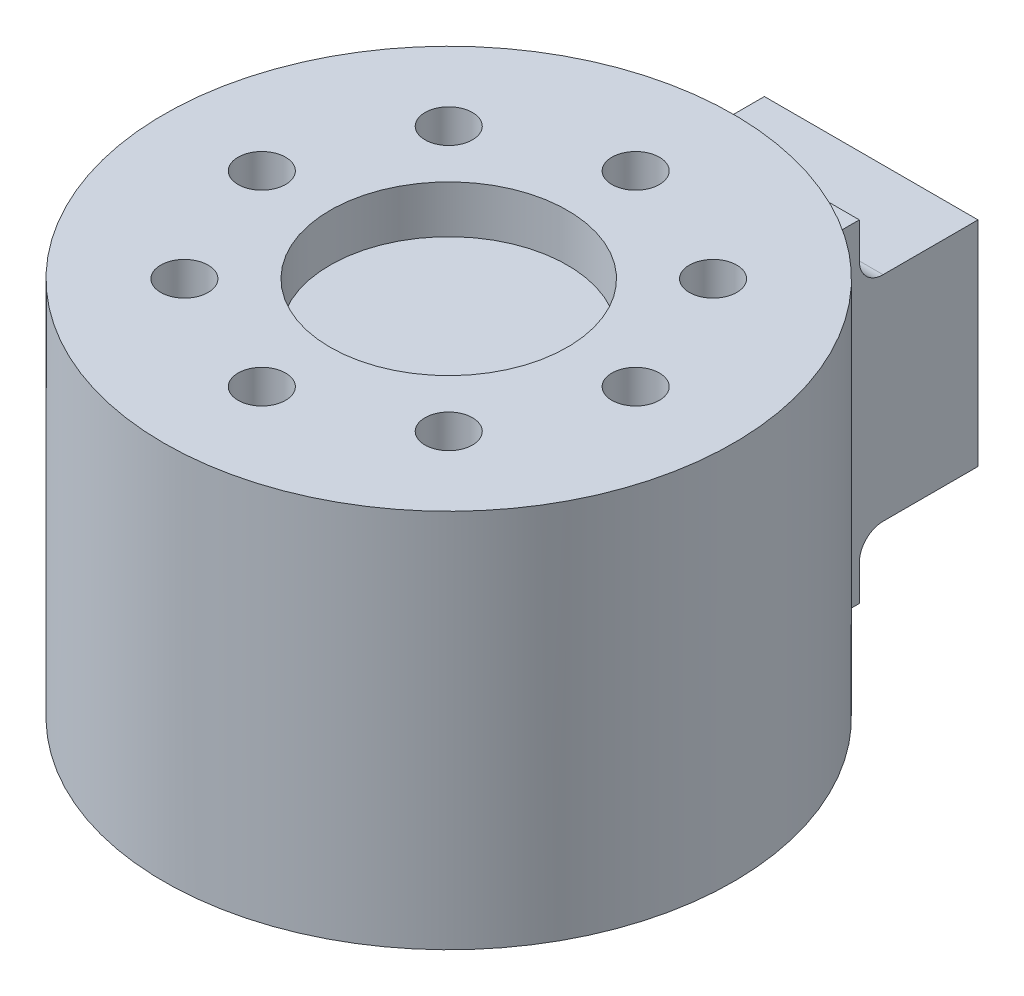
ISO-10303-21;
HEADER;
FILE_DESCRIPTION(('STEP AP214'),'2;1');
FILE_NAME('part.step','',(''),(''),'','','');
FILE_SCHEMA(('AUTOMOTIVE_DESIGN { 1 0 10303 214 1 1 1 1 }'));
ENDSEC;
DATA;
#1=APPLICATION_CONTEXT('core data for automotive mechanical design processes');
#2=APPLICATION_PROTOCOL_DEFINITION('international standard','automotive_design',2000,#1);
#3=PRODUCT_CONTEXT('',#1,'mechanical');
#4=PRODUCT('Part','Part','',(#3));
#5=PRODUCT_RELATED_PRODUCT_CATEGORY('part','',(#4));
#6=PRODUCT_DEFINITION_FORMATION('','',#4);
#7=PRODUCT_DEFINITION_CONTEXT('part definition',#1,'design');
#8=PRODUCT_DEFINITION('design','',#6,#7);
#9=PRODUCT_DEFINITION_SHAPE('','',#8);
#10=(LENGTH_UNIT() NAMED_UNIT(*) SI_UNIT(.MILLI.,.METRE.));
#11=(NAMED_UNIT(*) PLANE_ANGLE_UNIT() SI_UNIT($,.RADIAN.));
#12=(NAMED_UNIT(*) SI_UNIT($,.STERADIAN.) SOLID_ANGLE_UNIT());
#13=UNCERTAINTY_MEASURE_WITH_UNIT(LENGTH_MEASURE(1.E-05),#10,'distance_accuracy_value','');
#14=(GEOMETRIC_REPRESENTATION_CONTEXT(3) GLOBAL_UNCERTAINTY_ASSIGNED_CONTEXT((#13)) GLOBAL_UNIT_ASSIGNED_CONTEXT((#10,
#11,#12)) REPRESENTATION_CONTEXT('',''));
#15=CARTESIAN_POINT('',(0.,0.,0.));
#16=DIRECTION('',(0.,0.,1.));
#17=DIRECTION('',(1.,0.,0.));
#18=AXIS2_PLACEMENT_3D('',#15,#16,#17);
#19=CARTESIAN_POINT('',(0.,32.,0.));
#20=DIRECTION('',(0.,-1.,0.));
#21=DIRECTION('',(0.,0.,-1.));
#22=AXIS2_PLACEMENT_3D('',#19,#20,#21);
#23=CYLINDRICAL_SURFACE('',#22,24.);
#24=CARTESIAN_POINT('',(0.,0.,0.));
#25=DIRECTION('',(0.,1.,0.));
#26=DIRECTION('',(0.,0.,1.));
#27=AXIS2_PLACEMENT_3D('',#24,#25,#26);
#28=CIRCLE('',#27,24.);
#29=CARTESIAN_POINT('',(-9.,0.,-22.248595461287));
#30=VERTEX_POINT('',#29);
#31=CARTESIAN_POINT('',(9.,0.,-22.248595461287));
#32=VERTEX_POINT('',#31);
#33=EDGE_CURVE('E152',#30,#32,#28,.T.);
#34=ORIENTED_EDGE('',*,*,#33,.T.);
#35=DIRECTION('',(0.,-1.,0.));
#36=VECTOR('',#35,1.);
#37=CARTESIAN_POINT('',(9.,32.,-22.248595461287));
#38=LINE('',#37,#36);
#39=CARTESIAN_POINT('',(9.,28.,-22.248595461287));
#40=VERTEX_POINT('',#39);
#41=EDGE_CURVE('E145',#32,#40,#38,.F.);
#42=ORIENTED_EDGE('',*,*,#41,.T.);
#43=CARTESIAN_POINT('',(0.,28.,0.));
#44=DIRECTION('',(0.,1.,0.));
#45=DIRECTION('',(0.,0.,1.));
#46=AXIS2_PLACEMENT_3D('',#43,#44,#45);
#47=CIRCLE('',#46,24.);
#48=CARTESIAN_POINT('',(-9.,28.,-22.248595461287));
#49=VERTEX_POINT('',#48);
#50=EDGE_CURVE('E130',#40,#49,#47,.T.);
#51=ORIENTED_EDGE('',*,*,#50,.T.);
#52=DIRECTION('',(0.,-1.,0.));
#53=VECTOR('',#52,1.);
#54=CARTESIAN_POINT('',(-9.,32.,-22.248595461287));
#55=LINE('',#54,#53);
#56=EDGE_CURVE('E142',#49,#30,#55,.T.);
#57=ORIENTED_EDGE('',*,*,#56,.T.);
#58=EDGE_LOOP('',(#34,#42,#51,#57));
#59=FACE_BOUND('',#58,.T.);
#60=CARTESIAN_POINT('',(0.,32.,0.));
#61=DIRECTION('',(0.,1.,0.));
#62=DIRECTION('',(0.,0.,1.));
#63=AXIS2_PLACEMENT_3D('',#60,#61,#62);
#64=CIRCLE('',#63,24.);
#65=CARTESIAN_POINT('',(0.,32.,24.));
#66=VERTEX_POINT('',#65);
#67=EDGE_CURVE('E155',#66,#66,#64,.T.);
#68=ORIENTED_EDGE('',*,*,#67,.F.);
#69=EDGE_LOOP('',(#68));
#70=FACE_BOUND('',#69,.T.);
#71=ADVANCED_FACE('F38',(#59,#70),#23,.T.);
#72=CARTESIAN_POINT('',(0.,32.,0.));
#73=DIRECTION('',(0.,1.,0.));
#74=DIRECTION('',(0.,0.,1.));
#75=AXIS2_PLACEMENT_3D('',#72,#73,#74);
#76=PLANE('',#75);
#77=CARTESIAN_POINT('',(-15.75,32.,0.));
#78=DIRECTION('',(0.,1.,0.));
#79=DIRECTION('',(-1.,0.,0.));
#80=AXIS2_PLACEMENT_3D('',#77,#78,#79);
#81=CIRCLE('',#80,2.);
#82=CARTESIAN_POINT('',(-17.75,32.,0.));
#83=VERTEX_POINT('',#82);
#84=EDGE_CURVE('E233',#83,#83,#81,.T.);
#85=ORIENTED_EDGE('',*,*,#84,.F.);
#86=EDGE_LOOP('',(#85));
#87=FACE_BOUND('',#86,.T.);
#88=CARTESIAN_POINT('',(-11.1369318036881,32.,-11.1369318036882));
#89=DIRECTION('',(0.,1.,0.));
#90=DIRECTION('',(-0.707106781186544,0.,-0.707106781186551));
#91=AXIS2_PLACEMENT_3D('',#88,#89,#90);
#92=CIRCLE('',#91,2.);
#93=CARTESIAN_POINT('',(-12.5511453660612,32.,-12.5511453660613));
#94=VERTEX_POINT('',#93);
#95=EDGE_CURVE('E239',#94,#94,#92,.T.);
#96=ORIENTED_EDGE('',*,*,#95,.F.);
#97=EDGE_LOOP('',(#96));
#98=FACE_BOUND('',#97,.T.);
#99=CARTESIAN_POINT('',(0.,32.,-15.75));
#100=DIRECTION('',(0.,1.,0.));
#101=DIRECTION('',(0.,0.,-1.));
#102=AXIS2_PLACEMENT_3D('',#99,#100,#101);
#103=CIRCLE('',#102,2.);
#104=CARTESIAN_POINT('',(0.,32.,-17.75));
#105=VERTEX_POINT('',#104);
#106=EDGE_CURVE('E245',#105,#105,#103,.T.);
#107=ORIENTED_EDGE('',*,*,#106,.F.);
#108=EDGE_LOOP('',(#107));
#109=FACE_BOUND('',#108,.T.);
#110=CARTESIAN_POINT('',(11.1369318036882,32.,-11.136931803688));
#111=DIRECTION('',(0.,1.,0.));
#112=DIRECTION('',(0.707106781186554,0.,-0.707106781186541));
#113=AXIS2_PLACEMENT_3D('',#110,#111,#112);
#114=CIRCLE('',#113,2.);
#115=CARTESIAN_POINT('',(12.5511453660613,32.,-12.5511453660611));
#116=VERTEX_POINT('',#115);
#117=EDGE_CURVE('E220',#116,#116,#114,.T.);
#118=ORIENTED_EDGE('',*,*,#117,.F.);
#119=EDGE_LOOP('',(#118));
#120=FACE_BOUND('',#119,.T.);
#121=CARTESIAN_POINT('',(15.75,32.,1.64972493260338E-13));
#122=DIRECTION('',(0.,1.,0.));
#123=DIRECTION('',(1.,0.,0.));
#124=AXIS2_PLACEMENT_3D('',#121,#122,#123);
#125=CIRCLE('',#124,2.);
#126=CARTESIAN_POINT('',(17.75,32.,1.85921381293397E-13));
#127=VERTEX_POINT('',#126);
#128=EDGE_CURVE('E221',#127,#127,#125,.T.);
#129=ORIENTED_EDGE('',*,*,#128,.F.);
#130=EDGE_LOOP('',(#129));
#131=FACE_BOUND('',#130,.T.);
#132=CARTESIAN_POINT('',(11.136931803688,32.,11.1369318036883));
#133=DIRECTION('',(0.,1.,0.));
#134=DIRECTION('',(0.707106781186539,0.,0.707106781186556));
#135=AXIS2_PLACEMENT_3D('',#132,#133,#134);
#136=CIRCLE('',#135,2.);
#137=CARTESIAN_POINT('',(12.5511453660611,32.,12.5511453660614));
#138=VERTEX_POINT('',#137);
#139=EDGE_CURVE('E216',#138,#138,#136,.T.);
#140=ORIENTED_EDGE('',*,*,#139,.F.);
#141=EDGE_LOOP('',(#140));
#142=FACE_BOUND('',#141,.T.);
#143=CARTESIAN_POINT('',(-11.1369318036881,32.,11.1369318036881));
#144=DIRECTION('',(0.,1.,0.));
#145=DIRECTION('',(-0.707106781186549,0.,0.707106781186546));
#146=AXIS2_PLACEMENT_3D('',#143,#144,#145);
#147=CIRCLE('',#146,2.);
#148=CARTESIAN_POINT('',(-12.5511453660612,32.,12.5511453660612));
#149=VERTEX_POINT('',#148);
#150=EDGE_CURVE('E232',#149,#149,#147,.T.);
#151=ORIENTED_EDGE('',*,*,#150,.F.);
#152=EDGE_LOOP('',(#151));
#153=FACE_BOUND('',#152,.T.);
#154=CARTESIAN_POINT('',(0.,32.,15.75));
#155=DIRECTION('',(0.,1.,0.));
#156=DIRECTION('',(0.,0.,1.));
#157=AXIS2_PLACEMENT_3D('',#154,#155,#156);
#158=CIRCLE('',#157,2.);
#159=CARTESIAN_POINT('',(0.,32.,17.75));
#160=VERTEX_POINT('',#159);
#161=EDGE_CURVE('E298',#160,#160,#158,.T.);
#162=ORIENTED_EDGE('',*,*,#161,.F.);
#163=EDGE_LOOP('',(#162));
#164=FACE_BOUND('',#163,.T.);
#165=CARTESIAN_POINT('',(0.,32.,0.));
#166=DIRECTION('',(0.,1.,0.));
#167=DIRECTION('',(0.,0.,1.));
#168=AXIS2_PLACEMENT_3D('',#165,#166,#167);
#169=CIRCLE('',#168,10.);
#170=CARTESIAN_POINT('',(0.,32.,10.));
#171=VERTEX_POINT('',#170);
#172=EDGE_CURVE('E148',#171,#171,#169,.T.);
#173=ORIENTED_EDGE('',*,*,#172,.F.);
#174=EDGE_LOOP('',(#173));
#175=FACE_BOUND('',#174,.T.);
#176=ORIENTED_EDGE('',*,*,#67,.T.);
#177=EDGE_LOOP('',(#176));
#178=FACE_BOUND('',#177,.T.);
#179=ADVANCED_FACE('F321',(#87,#98,#109,#120,#131,#142,#153,#164,#175,#178),#76,.T.);
#180=CARTESIAN_POINT('',(0.,0.,0.));
#181=DIRECTION('',(0.,1.,0.));
#182=DIRECTION('',(0.,0.,1.));
#183=AXIS2_PLACEMENT_3D('',#180,#181,#182);
#184=PLANE('',#183);
#185=CARTESIAN_POINT('',(0.,0.,22.));
#186=DIRECTION('',(0.,-1.,0.));
#187=DIRECTION('',(1.,0.,0.));
#188=AXIS2_PLACEMENT_3D('',#185,#186,#187);
#189=CIRCLE('',#188,1.5);
#190=CARTESIAN_POINT('',(1.49999999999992,0.,22.));
#191=VERTEX_POINT('',#190);
#192=EDGE_CURVE('E275',#191,#191,#189,.T.);
#193=ORIENTED_EDGE('',*,*,#192,.F.);
#194=EDGE_LOOP('',(#193));
#195=FACE_BOUND('',#194,.T.);
#196=CARTESIAN_POINT('',(-15.5563491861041,0.,15.556349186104));
#197=DIRECTION('',(0.,-1.,0.));
#198=DIRECTION('',(0.707106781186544,0.,0.707106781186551));
#199=AXIS2_PLACEMENT_3D('',#196,#197,#198);
#200=CIRCLE('',#199,1.5);
#201=CARTESIAN_POINT('',(-14.4956890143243,0.,16.6170093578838));
#202=VERTEX_POINT('',#201);
#203=EDGE_CURVE('E281',#202,#202,#200,.T.);
#204=ORIENTED_EDGE('',*,*,#203,.F.);
#205=EDGE_LOOP('',(#204));
#206=FACE_BOUND('',#205,.T.);
#207=CARTESIAN_POINT('',(-22.,0.,0.));
#208=DIRECTION('',(0.,-1.,0.));
#209=DIRECTION('',(0.,0.,1.));
#210=AXIS2_PLACEMENT_3D('',#207,#208,#209);
#211=CIRCLE('',#210,1.5);
#212=CARTESIAN_POINT('',(-22.,0.,1.5));
#213=VERTEX_POINT('',#212);
#214=EDGE_CURVE('E287',#213,#213,#211,.T.);
#215=ORIENTED_EDGE('',*,*,#214,.F.);
#216=EDGE_LOOP('',(#215));
#217=FACE_BOUND('',#216,.T.);
#218=CARTESIAN_POINT('',(-15.5563491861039,0.,-15.5563491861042));
#219=DIRECTION('',(0.,-1.,0.));
#220=DIRECTION('',(-0.707106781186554,0.,0.707106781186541));
#221=AXIS2_PLACEMENT_3D('',#218,#219,#220);
#222=CIRCLE('',#221,1.5);
#223=CARTESIAN_POINT('',(-16.6170093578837,0.,-14.4956890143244));
#224=VERTEX_POINT('',#223);
#225=EDGE_CURVE('E262',#224,#224,#222,.T.);
#226=ORIENTED_EDGE('',*,*,#225,.F.);
#227=EDGE_LOOP('',(#226));
#228=FACE_BOUND('',#227,.T.);
#229=CARTESIAN_POINT('',(2.30437768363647E-13,0.,-22.));
#230=DIRECTION('',(0.,-1.,0.));
#231=DIRECTION('',(-1.,0.,0.));
#232=AXIS2_PLACEMENT_3D('',#229,#230,#231);
#233=CIRCLE('',#232,1.5);
#234=CARTESIAN_POINT('',(-1.49999999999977,0.,-22.));
#235=VERTEX_POINT('',#234);
#236=EDGE_CURVE('E263',#235,#235,#233,.T.);
#237=ORIENTED_EDGE('',*,*,#236,.F.);
#238=EDGE_LOOP('',(#237));
#239=FACE_BOUND('',#238,.T.);
#240=CARTESIAN_POINT('',(15.5563491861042,0.,-15.5563491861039));
#241=DIRECTION('',(0.,-1.,0.));
#242=DIRECTION('',(-0.707106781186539,0.,-0.707106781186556));
#243=AXIS2_PLACEMENT_3D('',#240,#241,#242);
#244=CIRCLE('',#243,1.5);
#245=CARTESIAN_POINT('',(14.4956890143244,0.,-16.6170093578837));
#246=VERTEX_POINT('',#245);
#247=EDGE_CURVE('E256',#246,#246,#244,.T.);
#248=ORIENTED_EDGE('',*,*,#247,.F.);
#249=EDGE_LOOP('',(#248));
#250=FACE_BOUND('',#249,.T.);
#251=CARTESIAN_POINT('',(15.556349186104,0.,15.5563491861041));
#252=DIRECTION('',(0.,-1.,0.));
#253=DIRECTION('',(0.707106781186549,0.,-0.707106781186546));
#254=AXIS2_PLACEMENT_3D('',#251,#252,#253);
#255=CIRCLE('',#254,1.5);
#256=CARTESIAN_POINT('',(16.6170093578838,0.,14.4956890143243));
#257=VERTEX_POINT('',#256);
#258=EDGE_CURVE('E274',#257,#257,#255,.T.);
#259=ORIENTED_EDGE('',*,*,#258,.F.);
#260=EDGE_LOOP('',(#259));
#261=FACE_BOUND('',#260,.T.);
#262=CARTESIAN_POINT('',(22.,0.,0.));
#263=DIRECTION('',(0.,-1.,0.));
#264=DIRECTION('',(0.,0.,-1.));
#265=AXIS2_PLACEMENT_3D('',#262,#263,#264);
#266=CIRCLE('',#265,1.5);
#267=CARTESIAN_POINT('',(22.,0.,-1.5));
#268=VERTEX_POINT('',#267);
#269=EDGE_CURVE('E304',#268,#268,#266,.T.);
#270=ORIENTED_EDGE('',*,*,#269,.F.);
#271=EDGE_LOOP('',(#270));
#272=FACE_BOUND('',#271,.T.);
#273=DIRECTION('',(0.,0.,1.));
#274=VECTOR('',#273,1.);
#275=CARTESIAN_POINT('',(-9.,0.,-35.6));
#276=LINE('',#275,#274);
#277=CARTESIAN_POINT('',(-9.,0.,-25.6));
#278=VERTEX_POINT('',#277);
#279=EDGE_CURVE('E135',#278,#30,#276,.T.);
#280=ORIENTED_EDGE('',*,*,#279,.F.);
#281=DIRECTION('',(1.,0.,0.));
#282=VECTOR('',#281,1.);
#283=CARTESIAN_POINT('',(-24.,0.,-25.6));
#284=LINE('',#283,#282);
#285=CARTESIAN_POINT('',(9.,0.,-25.6));
#286=VERTEX_POINT('',#285);
#287=EDGE_CURVE('E126',#278,#286,#284,.T.);
#288=ORIENTED_EDGE('',*,*,#287,.T.);
#289=DIRECTION('',(0.,0.,1.));
#290=VECTOR('',#289,1.);
#291=CARTESIAN_POINT('',(9.,0.,-35.6));
#292=LINE('',#291,#290);
#293=EDGE_CURVE('E146',#286,#32,#292,.T.);
#294=ORIENTED_EDGE('',*,*,#293,.T.);
#295=ORIENTED_EDGE('',*,*,#33,.F.);
#296=EDGE_LOOP('',(#280,#288,#294,#295));
#297=FACE_BOUND('',#296,.T.);
#298=ADVANCED_FACE('F318',(#195,#206,#217,#228,#239,#250,#261,#272,#297),#184,.F.);
#299=CARTESIAN_POINT('',(0.,28.,0.));
#300=DIRECTION('',(0.,1.,0.));
#301=DIRECTION('',(0.,0.,1.));
#302=AXIS2_PLACEMENT_3D('',#299,#300,#301);
#303=CYLINDRICAL_SURFACE('',#302,10.);
#304=CARTESIAN_POINT('',(0.,28.,0.));
#305=DIRECTION('',(0.,1.,0.));
#306=DIRECTION('',(0.,0.,1.));
#307=AXIS2_PLACEMENT_3D('',#304,#305,#306);
#308=CIRCLE('',#307,10.);
#309=CARTESIAN_POINT('',(0.,28.,10.));
#310=VERTEX_POINT('',#309);
#311=EDGE_CURVE('E149',#310,#310,#308,.T.);
#312=ORIENTED_EDGE('',*,*,#311,.F.);
#313=EDGE_LOOP('',(#312));
#314=FACE_BOUND('',#313,.T.);
#315=ORIENTED_EDGE('',*,*,#172,.T.);
#316=EDGE_LOOP('',(#315));
#317=FACE_BOUND('',#316,.T.);
#318=ADVANCED_FACE('F320',(#314,#317),#303,.F.);
#319=CARTESIAN_POINT('',(0.,28.,0.));
#320=DIRECTION('',(0.,1.,0.));
#321=DIRECTION('',(0.,0.,1.));
#322=AXIS2_PLACEMENT_3D('',#319,#320,#321);
#323=PLANE('',#322);
#324=ORIENTED_EDGE('',*,*,#311,.T.);
#325=EDGE_LOOP('',(#324));
#326=FACE_BOUND('',#325,.T.);
#327=ADVANCED_FACE('F328',(#326),#323,.T.);
#328=CARTESIAN_POINT('',(9.,28.,-35.6));
#329=DIRECTION('',(1.,0.,0.));
#330=DIRECTION('',(0.,0.,-1.));
#331=AXIS2_PLACEMENT_3D('',#328,#329,#330);
#332=PLANE('',#331);
#333=DIRECTION('',(0.,0.,-1.));
#334=VECTOR('',#333,1.);
#335=CARTESIAN_POINT('',(9.,23.,-35.6));
#336=LINE('',#335,#334);
#337=CARTESIAN_POINT('',(9.,23.,-27.6));
#338=VERTEX_POINT('',#337);
#339=CARTESIAN_POINT('',(9.,23.,-35.6));
#340=VERTEX_POINT('',#339);
#341=EDGE_CURVE('E120',#338,#340,#336,.T.);
#342=ORIENTED_EDGE('',*,*,#341,.F.);
#343=CARTESIAN_POINT('',(9.,25.,-27.6));
#344=DIRECTION('',(1.,0.,0.));
#345=DIRECTION('',(0.,0.,-1.));
#346=AXIS2_PLACEMENT_3D('',#343,#344,#345);
#347=CIRCLE('',#346,2.);
#348=CARTESIAN_POINT('',(9.,25.,-25.6));
#349=VERTEX_POINT('',#348);
#350=EDGE_CURVE('E46',#338,#349,#347,.F.);
#351=ORIENTED_EDGE('',*,*,#350,.T.);
#352=DIRECTION('',(0.,-1.,0.));
#353=VECTOR('',#352,1.);
#354=CARTESIAN_POINT('',(9.,28.,-25.6));
#355=LINE('',#354,#353);
#356=CARTESIAN_POINT('',(9.,28.,-25.6));
#357=VERTEX_POINT('',#356);
#358=EDGE_CURVE('E114',#357,#349,#355,.T.);
#359=ORIENTED_EDGE('',*,*,#358,.F.);
#360=DIRECTION('',(0.,0.,1.));
#361=VECTOR('',#360,1.);
#362=CARTESIAN_POINT('',(9.,28.,-35.6));
#363=LINE('',#362,#361);
#364=EDGE_CURVE('E124',#357,#40,#363,.T.);
#365=ORIENTED_EDGE('',*,*,#364,.T.);
#366=ORIENTED_EDGE('',*,*,#41,.F.);
#367=ORIENTED_EDGE('',*,*,#293,.F.);
#368=DIRECTION('',(0.,-1.,0.));
#369=VECTOR('',#368,1.);
#370=CARTESIAN_POINT('',(9.,0.,-25.6));
#371=LINE('',#370,#369);
#372=CARTESIAN_POINT('',(9.,3.,-25.6));
#373=VERTEX_POINT('',#372);
#374=EDGE_CURVE('E203',#373,#286,#371,.T.);
#375=ORIENTED_EDGE('',*,*,#374,.F.);
#376=CARTESIAN_POINT('',(9.,3.,-27.6));
#377=DIRECTION('',(1.,0.,0.));
#378=DIRECTION('',(0.,0.,-1.));
#379=AXIS2_PLACEMENT_3D('',#376,#377,#378);
#380=CIRCLE('',#379,2.);
#381=CARTESIAN_POINT('',(9.,5.,-27.6));
#382=VERTEX_POINT('',#381);
#383=EDGE_CURVE('E179',#373,#382,#380,.F.);
#384=ORIENTED_EDGE('',*,*,#383,.T.);
#385=DIRECTION('',(0.,0.,1.));
#386=VECTOR('',#385,1.);
#387=CARTESIAN_POINT('',(9.,5.,-35.6));
#388=LINE('',#387,#386);
#389=CARTESIAN_POINT('',(9.,5.,-35.6));
#390=VERTEX_POINT('',#389);
#391=EDGE_CURVE('E200',#390,#382,#388,.T.);
#392=ORIENTED_EDGE('',*,*,#391,.F.);
#393=DIRECTION('',(0.,1.,0.));
#394=VECTOR('',#393,1.);
#395=CARTESIAN_POINT('',(9.,28.,-35.6));
#396=LINE('',#395,#394);
#397=EDGE_CURVE('E138',#390,#340,#396,.T.);
#398=ORIENTED_EDGE('',*,*,#397,.T.);
#399=EDGE_LOOP('',(#342,#351,#359,#365,#366,#367,#375,#384,#392,#398));
#400=FACE_BOUND('',#399,.T.);
#401=ADVANCED_FACE('F122',(#400),#332,.T.);
#402=CARTESIAN_POINT('',(-9.,28.,-35.6));
#403=DIRECTION('',(-1.,0.,0.));
#404=DIRECTION('',(0.,0.,1.));
#405=AXIS2_PLACEMENT_3D('',#402,#403,#404);
#406=PLANE('',#405);
#407=DIRECTION('',(0.,0.,1.));
#408=VECTOR('',#407,1.);
#409=CARTESIAN_POINT('',(-9.,23.,-35.6));
#410=LINE('',#409,#408);
#411=CARTESIAN_POINT('',(-9.,23.,-35.6));
#412=VERTEX_POINT('',#411);
#413=CARTESIAN_POINT('',(-9.,23.,-27.6));
#414=VERTEX_POINT('',#413);
#415=EDGE_CURVE('E212',#412,#414,#410,.T.);
#416=ORIENTED_EDGE('',*,*,#415,.F.);
#417=DIRECTION('',(0.,-1.,0.));
#418=VECTOR('',#417,1.);
#419=CARTESIAN_POINT('',(-9.,28.,-35.6));
#420=LINE('',#419,#418);
#421=CARTESIAN_POINT('',(-9.,5.,-35.6));
#422=VERTEX_POINT('',#421);
#423=EDGE_CURVE('E133',#412,#422,#420,.T.);
#424=ORIENTED_EDGE('',*,*,#423,.T.);
#425=DIRECTION('',(0.,0.,-1.));
#426=VECTOR('',#425,1.);
#427=CARTESIAN_POINT('',(-9.,5.,-35.6));
#428=LINE('',#427,#426);
#429=CARTESIAN_POINT('',(-9.,5.,-27.6));
#430=VERTEX_POINT('',#429);
#431=EDGE_CURVE('E119',#430,#422,#428,.T.);
#432=ORIENTED_EDGE('',*,*,#431,.F.);
#433=CARTESIAN_POINT('',(-9.,3.,-27.6));
#434=DIRECTION('',(-1.,0.,0.));
#435=DIRECTION('',(0.,0.,1.));
#436=AXIS2_PLACEMENT_3D('',#433,#434,#435);
#437=CIRCLE('',#436,2.);
#438=CARTESIAN_POINT('',(-9.,3.,-25.6));
#439=VERTEX_POINT('',#438);
#440=EDGE_CURVE('E181',#430,#439,#437,.F.);
#441=ORIENTED_EDGE('',*,*,#440,.T.);
#442=DIRECTION('',(0.,1.,0.));
#443=VECTOR('',#442,1.);
#444=CARTESIAN_POINT('',(-9.,28.,-25.6));
#445=LINE('',#444,#443);
#446=EDGE_CURVE('E167',#278,#439,#445,.T.);
#447=ORIENTED_EDGE('',*,*,#446,.F.);
#448=ORIENTED_EDGE('',*,*,#279,.T.);
#449=ORIENTED_EDGE('',*,*,#56,.F.);
#450=DIRECTION('',(0.,0.,1.));
#451=VECTOR('',#450,1.);
#452=CARTESIAN_POINT('',(-9.,28.,-35.6));
#453=LINE('',#452,#451);
#454=CARTESIAN_POINT('',(-9.,28.,-25.6));
#455=VERTEX_POINT('',#454);
#456=EDGE_CURVE('E132',#455,#49,#453,.T.);
#457=ORIENTED_EDGE('',*,*,#456,.F.);
#458=DIRECTION('',(0.,1.,0.));
#459=VECTOR('',#458,1.);
#460=CARTESIAN_POINT('',(-9.,28.,-25.6));
#461=LINE('',#460,#459);
#462=CARTESIAN_POINT('',(-9.,25.,-25.6));
#463=VERTEX_POINT('',#462);
#464=EDGE_CURVE('E115',#463,#455,#461,.T.);
#465=ORIENTED_EDGE('',*,*,#464,.F.);
#466=CARTESIAN_POINT('',(-9.,25.,-27.6));
#467=DIRECTION('',(-1.,0.,0.));
#468=DIRECTION('',(0.,0.,1.));
#469=AXIS2_PLACEMENT_3D('',#466,#467,#468);
#470=CIRCLE('',#469,2.);
#471=EDGE_CURVE('E11',#463,#414,#470,.F.);
#472=ORIENTED_EDGE('',*,*,#471,.T.);
#473=EDGE_LOOP('',(#416,#424,#432,#441,#447,#448,#449,#457,#465,#472));
#474=FACE_BOUND('',#473,.T.);
#475=ADVANCED_FACE('F187',(#474),#406,.T.);
#476=CARTESIAN_POINT('',(-9.,28.,-35.6));
#477=DIRECTION('',(0.,1.,0.));
#478=DIRECTION('',(0.,0.,1.));
#479=AXIS2_PLACEMENT_3D('',#476,#477,#478);
#480=PLANE('',#479);
#481=DIRECTION('',(1.,0.,0.));
#482=VECTOR('',#481,1.);
#483=CARTESIAN_POINT('',(-24.,28.,-25.6));
#484=LINE('',#483,#482);
#485=EDGE_CURVE('E112',#455,#357,#484,.T.);
#486=ORIENTED_EDGE('',*,*,#485,.F.);
#487=ORIENTED_EDGE('',*,*,#456,.T.);
#488=ORIENTED_EDGE('',*,*,#50,.F.);
#489=ORIENTED_EDGE('',*,*,#364,.F.);
#490=EDGE_LOOP('',(#486,#487,#488,#489));
#491=FACE_BOUND('',#490,.T.);
#492=ADVANCED_FACE('F128',(#491),#480,.T.);
#493=CARTESIAN_POINT('',(0.,0.,-35.6));
#494=DIRECTION('',(0.,0.,1.));
#495=DIRECTION('',(1.,0.,0.));
#496=AXIS2_PLACEMENT_3D('',#493,#494,#495);
#497=PLANE('',#496);
#498=ORIENTED_EDGE('',*,*,#423,.F.);
#499=DIRECTION('',(1.,0.,0.));
#500=VECTOR('',#499,1.);
#501=CARTESIAN_POINT('',(0.,23.,-35.6));
#502=LINE('',#501,#500);
#503=EDGE_CURVE('E164',#412,#340,#502,.T.);
#504=ORIENTED_EDGE('',*,*,#503,.T.);
#505=ORIENTED_EDGE('',*,*,#397,.F.);
#506=DIRECTION('',(-1.,0.,0.));
#507=VECTOR('',#506,1.);
#508=CARTESIAN_POINT('',(0.,5.,-35.6));
#509=LINE('',#508,#507);
#510=EDGE_CURVE('E161',#390,#422,#509,.T.);
#511=ORIENTED_EDGE('',*,*,#510,.T.);
#512=EDGE_LOOP('',(#498,#504,#505,#511));
#513=FACE_BOUND('',#512,.T.);
#514=ADVANCED_FACE('F484',(#513),#497,.F.);
#515=CARTESIAN_POINT('',(22.,4.,0.));
#516=DIRECTION('',(0.,-1.,0.));
#517=DIRECTION('',(0.,0.,-1.));
#518=AXIS2_PLACEMENT_3D('',#515,#516,#517);
#519=CYLINDRICAL_SURFACE('',#518,1.5);
#520=CARTESIAN_POINT('',(22.,4.,0.));
#521=DIRECTION('',(0.,-1.,0.));
#522=DIRECTION('',(0.,0.,-1.));
#523=AXIS2_PLACEMENT_3D('',#520,#521,#522);
#524=CIRCLE('',#523,1.5);
#525=CARTESIAN_POINT('',(22.,4.,-1.5));
#526=VERTEX_POINT('',#525);
#527=EDGE_CURVE('E307',#526,#526,#524,.T.);
#528=ORIENTED_EDGE('',*,*,#527,.F.);
#529=EDGE_LOOP('',(#528));
#530=FACE_BOUND('',#529,.T.);
#531=ORIENTED_EDGE('',*,*,#269,.T.);
#532=EDGE_LOOP('',(#531));
#533=FACE_BOUND('',#532,.T.);
#534=ADVANCED_FACE('F480',(#530,#533),#519,.F.);
#535=CARTESIAN_POINT('',(22.,4.,0.));
#536=DIRECTION('',(0.,-1.,0.));
#537=DIRECTION('',(0.,0.,-1.));
#538=AXIS2_PLACEMENT_3D('',#535,#536,#537);
#539=PLANE('',#538);
#540=ORIENTED_EDGE('',*,*,#527,.T.);
#541=EDGE_LOOP('',(#540));
#542=FACE_BOUND('',#541,.T.);
#543=ADVANCED_FACE('F476',(#542),#539,.T.);
#544=CARTESIAN_POINT('',(0.,28.,15.75));
#545=DIRECTION('',(0.,1.,0.));
#546=DIRECTION('',(0.,0.,1.));
#547=AXIS2_PLACEMENT_3D('',#544,#545,#546);
#548=CYLINDRICAL_SURFACE('',#547,2.);
#549=CARTESIAN_POINT('',(0.,28.,15.75));
#550=DIRECTION('',(0.,1.,0.));
#551=DIRECTION('',(0.,0.,1.));
#552=AXIS2_PLACEMENT_3D('',#549,#550,#551);
#553=CIRCLE('',#552,2.);
#554=CARTESIAN_POINT('',(0.,28.,17.75));
#555=VERTEX_POINT('',#554);
#556=EDGE_CURVE('E301',#555,#555,#553,.T.);
#557=ORIENTED_EDGE('',*,*,#556,.F.);
#558=EDGE_LOOP('',(#557));
#559=FACE_BOUND('',#558,.T.);
#560=ORIENTED_EDGE('',*,*,#161,.T.);
#561=EDGE_LOOP('',(#560));
#562=FACE_BOUND('',#561,.T.);
#563=ADVANCED_FACE('F472',(#559,#562),#548,.F.);
#564=CARTESIAN_POINT('',(0.,28.,15.75));
#565=DIRECTION('',(0.,1.,0.));
#566=DIRECTION('',(0.,0.,1.));
#567=AXIS2_PLACEMENT_3D('',#564,#565,#566);
#568=PLANE('',#567);
#569=ORIENTED_EDGE('',*,*,#556,.T.);
#570=EDGE_LOOP('',(#569));
#571=FACE_BOUND('',#570,.T.);
#572=ADVANCED_FACE('F468',(#571),#568,.T.);
#573=CARTESIAN_POINT('',(15.556349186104,4.,15.5563491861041));
#574=DIRECTION('',(0.,-1.,0.));
#575=DIRECTION('',(0.,0.,-1.));
#576=AXIS2_PLACEMENT_3D('',#573,#574,#575);
#577=CYLINDRICAL_SURFACE('',#576,1.5);
#578=CARTESIAN_POINT('',(15.556349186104,4.,15.5563491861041));
#579=DIRECTION('',(0.,-1.,0.));
#580=DIRECTION('',(0.707106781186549,0.,-0.707106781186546));
#581=AXIS2_PLACEMENT_3D('',#578,#579,#580);
#582=CIRCLE('',#581,1.5);
#583=CARTESIAN_POINT('',(16.6170093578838,4.,14.4956890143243));
#584=VERTEX_POINT('',#583);
#585=EDGE_CURVE('E295',#584,#584,#582,.T.);
#586=ORIENTED_EDGE('',*,*,#585,.F.);
#587=EDGE_LOOP('',(#586));
#588=FACE_BOUND('',#587,.T.);
#589=ORIENTED_EDGE('',*,*,#258,.T.);
#590=EDGE_LOOP('',(#589));
#591=FACE_BOUND('',#590,.T.);
#592=ADVANCED_FACE('F464',(#588,#591),#577,.F.);
#593=CARTESIAN_POINT('',(15.556349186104,4.,15.5563491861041));
#594=DIRECTION('',(0.,-1.,0.));
#595=DIRECTION('',(0.707106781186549,0.,-0.707106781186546));
#596=AXIS2_PLACEMENT_3D('',#593,#594,#595);
#597=PLANE('',#596);
#598=ORIENTED_EDGE('',*,*,#585,.T.);
#599=EDGE_LOOP('',(#598));
#600=FACE_BOUND('',#599,.T.);
#601=ADVANCED_FACE('F430',(#600),#597,.T.);
#602=CARTESIAN_POINT('',(15.5563491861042,4.,-15.5563491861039));
#603=DIRECTION('',(0.,-1.,0.));
#604=DIRECTION('',(0.,0.,-1.));
#605=AXIS2_PLACEMENT_3D('',#602,#603,#604);
#606=CYLINDRICAL_SURFACE('',#605,1.5);
#607=CARTESIAN_POINT('',(15.5563491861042,4.,-15.5563491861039));
#608=DIRECTION('',(0.,-1.,0.));
#609=DIRECTION('',(-0.707106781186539,0.,-0.707106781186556));
#610=AXIS2_PLACEMENT_3D('',#607,#608,#609);
#611=CIRCLE('',#610,1.5);
#612=CARTESIAN_POINT('',(14.4956890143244,4.,-16.6170093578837));
#613=VERTEX_POINT('',#612);
#614=EDGE_CURVE('E266',#613,#613,#611,.T.);
#615=ORIENTED_EDGE('',*,*,#614,.F.);
#616=EDGE_LOOP('',(#615));
#617=FACE_BOUND('',#616,.T.);
#618=ORIENTED_EDGE('',*,*,#247,.T.);
#619=EDGE_LOOP('',(#618));
#620=FACE_BOUND('',#619,.T.);
#621=ADVANCED_FACE('F426',(#617,#620),#606,.F.);
#622=CARTESIAN_POINT('',(15.5563491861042,4.,-15.5563491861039));
#623=DIRECTION('',(0.,-1.,0.));
#624=DIRECTION('',(-0.707106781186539,0.,-0.707106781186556));
#625=AXIS2_PLACEMENT_3D('',#622,#623,#624);
#626=PLANE('',#625);
#627=ORIENTED_EDGE('',*,*,#614,.T.);
#628=EDGE_LOOP('',(#627));
#629=FACE_BOUND('',#628,.T.);
#630=ADVANCED_FACE('F422',(#629),#626,.T.);
#631=CARTESIAN_POINT('',(2.30437768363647E-13,4.,-22.));
#632=DIRECTION('',(0.,-1.,0.));
#633=DIRECTION('',(0.,0.,-1.));
#634=AXIS2_PLACEMENT_3D('',#631,#632,#633);
#635=CYLINDRICAL_SURFACE('',#634,1.5);
#636=CARTESIAN_POINT('',(2.30437768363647E-13,4.,-22.));
#637=DIRECTION('',(0.,-1.,0.));
#638=DIRECTION('',(-1.,0.,0.));
#639=AXIS2_PLACEMENT_3D('',#636,#637,#638);
#640=CIRCLE('',#639,1.5);
#641=CARTESIAN_POINT('',(-1.49999999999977,4.,-22.));
#642=VERTEX_POINT('',#641);
#643=EDGE_CURVE('E259',#642,#642,#640,.T.);
#644=ORIENTED_EDGE('',*,*,#643,.F.);
#645=EDGE_LOOP('',(#644));
#646=FACE_BOUND('',#645,.T.);
#647=ORIENTED_EDGE('',*,*,#236,.T.);
#648=EDGE_LOOP('',(#647));
#649=FACE_BOUND('',#648,.T.);
#650=ADVANCED_FACE('F418',(#646,#649),#635,.F.);
#651=CARTESIAN_POINT('',(2.30437768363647E-13,4.,-22.));
#652=DIRECTION('',(0.,-1.,0.));
#653=DIRECTION('',(-1.,0.,0.));
#654=AXIS2_PLACEMENT_3D('',#651,#652,#653);
#655=PLANE('',#654);
#656=ORIENTED_EDGE('',*,*,#643,.T.);
#657=EDGE_LOOP('',(#656));
#658=FACE_BOUND('',#657,.T.);
#659=ADVANCED_FACE('F414',(#658),#655,.T.);
#660=CARTESIAN_POINT('',(-15.5563491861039,4.,-15.5563491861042));
#661=DIRECTION('',(0.,-1.,0.));
#662=DIRECTION('',(0.,0.,-1.));
#663=AXIS2_PLACEMENT_3D('',#660,#661,#662);
#664=CYLINDRICAL_SURFACE('',#663,1.5);
#665=CARTESIAN_POINT('',(-15.5563491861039,4.,-15.5563491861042));
#666=DIRECTION('',(0.,-1.,0.));
#667=DIRECTION('',(-0.707106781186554,0.,0.707106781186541));
#668=AXIS2_PLACEMENT_3D('',#665,#666,#667);
#669=CIRCLE('',#668,1.5);
#670=CARTESIAN_POINT('',(-16.6170093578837,4.,-14.4956890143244));
#671=VERTEX_POINT('',#670);
#672=EDGE_CURVE('E290',#671,#671,#669,.T.);
#673=ORIENTED_EDGE('',*,*,#672,.F.);
#674=EDGE_LOOP('',(#673));
#675=FACE_BOUND('',#674,.T.);
#676=ORIENTED_EDGE('',*,*,#225,.T.);
#677=EDGE_LOOP('',(#676));
#678=FACE_BOUND('',#677,.T.);
#679=ADVANCED_FACE('F417',(#675,#678),#664,.F.);
#680=CARTESIAN_POINT('',(-15.5563491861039,4.,-15.5563491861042));
#681=DIRECTION('',(0.,-1.,0.));
#682=DIRECTION('',(-0.707106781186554,0.,0.707106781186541));
#683=AXIS2_PLACEMENT_3D('',#680,#681,#682);
#684=PLANE('',#683);
#685=ORIENTED_EDGE('',*,*,#672,.T.);
#686=EDGE_LOOP('',(#685));
#687=FACE_BOUND('',#686,.T.);
#688=ADVANCED_FACE('F454',(#687),#684,.T.);
#689=CARTESIAN_POINT('',(-22.,4.,0.));
#690=DIRECTION('',(0.,-1.,0.));
#691=DIRECTION('',(0.,0.,-1.));
#692=AXIS2_PLACEMENT_3D('',#689,#690,#691);
#693=CYLINDRICAL_SURFACE('',#692,1.5);
#694=CARTESIAN_POINT('',(-22.,4.,0.));
#695=DIRECTION('',(0.,-1.,0.));
#696=DIRECTION('',(0.,0.,1.));
#697=AXIS2_PLACEMENT_3D('',#694,#695,#696);
#698=CIRCLE('',#697,1.5);
#699=CARTESIAN_POINT('',(-22.,4.,1.5));
#700=VERTEX_POINT('',#699);
#701=EDGE_CURVE('E284',#700,#700,#698,.T.);
#702=ORIENTED_EDGE('',*,*,#701,.F.);
#703=EDGE_LOOP('',(#702));
#704=FACE_BOUND('',#703,.T.);
#705=ORIENTED_EDGE('',*,*,#214,.T.);
#706=EDGE_LOOP('',(#705));
#707=FACE_BOUND('',#706,.T.);
#708=ADVANCED_FACE('F450',(#704,#707),#693,.F.);
#709=CARTESIAN_POINT('',(-22.,4.,0.));
#710=DIRECTION('',(0.,-1.,0.));
#711=DIRECTION('',(0.,0.,1.));
#712=AXIS2_PLACEMENT_3D('',#709,#710,#711);
#713=PLANE('',#712);
#714=ORIENTED_EDGE('',*,*,#701,.T.);
#715=EDGE_LOOP('',(#714));
#716=FACE_BOUND('',#715,.T.);
#717=ADVANCED_FACE('F446',(#716),#713,.T.);
#718=CARTESIAN_POINT('',(-15.5563491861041,4.,15.556349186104));
#719=DIRECTION('',(0.,-1.,0.));
#720=DIRECTION('',(0.,0.,-1.));
#721=AXIS2_PLACEMENT_3D('',#718,#719,#720);
#722=CYLINDRICAL_SURFACE('',#721,1.5);
#723=CARTESIAN_POINT('',(-15.5563491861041,4.,15.556349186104));
#724=DIRECTION('',(0.,-1.,0.));
#725=DIRECTION('',(0.707106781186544,0.,0.707106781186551));
#726=AXIS2_PLACEMENT_3D('',#723,#724,#725);
#727=CIRCLE('',#726,1.5);
#728=CARTESIAN_POINT('',(-14.4956890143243,4.,16.6170093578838));
#729=VERTEX_POINT('',#728);
#730=EDGE_CURVE('E278',#729,#729,#727,.T.);
#731=ORIENTED_EDGE('',*,*,#730,.F.);
#732=EDGE_LOOP('',(#731));
#733=FACE_BOUND('',#732,.T.);
#734=ORIENTED_EDGE('',*,*,#203,.T.);
#735=EDGE_LOOP('',(#734));
#736=FACE_BOUND('',#735,.T.);
#737=ADVANCED_FACE('F442',(#733,#736),#722,.F.);
#738=CARTESIAN_POINT('',(-15.5563491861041,4.,15.556349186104));
#739=DIRECTION('',(0.,-1.,0.));
#740=DIRECTION('',(0.707106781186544,0.,0.707106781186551));
#741=AXIS2_PLACEMENT_3D('',#738,#739,#740);
#742=PLANE('',#741);
#743=ORIENTED_EDGE('',*,*,#730,.T.);
#744=EDGE_LOOP('',(#743));
#745=FACE_BOUND('',#744,.T.);
#746=ADVANCED_FACE('F438',(#745),#742,.T.);
#747=CARTESIAN_POINT('',(0.,4.,22.));
#748=DIRECTION('',(0.,-1.,0.));
#749=DIRECTION('',(0.,0.,-1.));
#750=AXIS2_PLACEMENT_3D('',#747,#748,#749);
#751=CYLINDRICAL_SURFACE('',#750,1.5);
#752=CARTESIAN_POINT('',(0.,4.,22.));
#753=DIRECTION('',(0.,-1.,0.));
#754=DIRECTION('',(1.,0.,0.));
#755=AXIS2_PLACEMENT_3D('',#752,#753,#754);
#756=CIRCLE('',#755,1.5);
#757=CARTESIAN_POINT('',(1.49999999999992,4.,22.));
#758=VERTEX_POINT('',#757);
#759=EDGE_CURVE('E271',#758,#758,#756,.T.);
#760=ORIENTED_EDGE('',*,*,#759,.F.);
#761=EDGE_LOOP('',(#760));
#762=FACE_BOUND('',#761,.T.);
#763=ORIENTED_EDGE('',*,*,#192,.T.);
#764=EDGE_LOOP('',(#763));
#765=FACE_BOUND('',#764,.T.);
#766=ADVANCED_FACE('F434',(#762,#765),#751,.F.);
#767=CARTESIAN_POINT('',(0.,4.,22.));
#768=DIRECTION('',(0.,-1.,0.));
#769=DIRECTION('',(1.,0.,0.));
#770=AXIS2_PLACEMENT_3D('',#767,#768,#769);
#771=PLANE('',#770);
#772=ORIENTED_EDGE('',*,*,#759,.T.);
#773=EDGE_LOOP('',(#772));
#774=FACE_BOUND('',#773,.T.);
#775=ADVANCED_FACE('F412',(#774),#771,.T.);
#776=CARTESIAN_POINT('',(-11.1369318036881,28.,11.1369318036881));
#777=DIRECTION('',(0.,1.,0.));
#778=DIRECTION('',(0.,0.,1.));
#779=AXIS2_PLACEMENT_3D('',#776,#777,#778);
#780=CYLINDRICAL_SURFACE('',#779,2.);
#781=CARTESIAN_POINT('',(-11.1369318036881,28.,11.1369318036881));
#782=DIRECTION('',(0.,1.,0.));
#783=DIRECTION('',(-0.707106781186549,0.,0.707106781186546));
#784=AXIS2_PLACEMENT_3D('',#781,#782,#783);
#785=CIRCLE('',#784,2.);
#786=CARTESIAN_POINT('',(-12.5511453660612,28.,12.5511453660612));
#787=VERTEX_POINT('',#786);
#788=EDGE_CURVE('E253',#787,#787,#785,.T.);
#789=ORIENTED_EDGE('',*,*,#788,.F.);
#790=EDGE_LOOP('',(#789));
#791=FACE_BOUND('',#790,.T.);
#792=ORIENTED_EDGE('',*,*,#150,.T.);
#793=EDGE_LOOP('',(#792));
#794=FACE_BOUND('',#793,.T.);
#795=ADVANCED_FACE('F408',(#791,#794),#780,.F.);
#796=CARTESIAN_POINT('',(-11.1369318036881,28.,11.1369318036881));
#797=DIRECTION('',(0.,1.,0.));
#798=DIRECTION('',(-0.707106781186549,0.,0.707106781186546));
#799=AXIS2_PLACEMENT_3D('',#796,#797,#798);
#800=PLANE('',#799);
#801=ORIENTED_EDGE('',*,*,#788,.T.);
#802=EDGE_LOOP('',(#801));
#803=FACE_BOUND('',#802,.T.);
#804=ADVANCED_FACE('F374',(#803),#800,.T.);
#805=CARTESIAN_POINT('',(11.136931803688,28.,11.1369318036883));
#806=DIRECTION('',(0.,1.,0.));
#807=DIRECTION('',(0.,0.,1.));
#808=AXIS2_PLACEMENT_3D('',#805,#806,#807);
#809=CYLINDRICAL_SURFACE('',#808,2.);
#810=CARTESIAN_POINT('',(11.136931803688,28.,11.1369318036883));
#811=DIRECTION('',(0.,1.,0.));
#812=DIRECTION('',(0.707106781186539,0.,0.707106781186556));
#813=AXIS2_PLACEMENT_3D('',#810,#811,#812);
#814=CIRCLE('',#813,2.);
#815=CARTESIAN_POINT('',(12.5511453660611,28.,12.5511453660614));
#816=VERTEX_POINT('',#815);
#817=EDGE_CURVE('E224',#816,#816,#814,.T.);
#818=ORIENTED_EDGE('',*,*,#817,.F.);
#819=EDGE_LOOP('',(#818));
#820=FACE_BOUND('',#819,.T.);
#821=ORIENTED_EDGE('',*,*,#139,.T.);
#822=EDGE_LOOP('',(#821));
#823=FACE_BOUND('',#822,.T.);
#824=ADVANCED_FACE('F370',(#820,#823),#809,.F.);
#825=CARTESIAN_POINT('',(11.136931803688,28.,11.1369318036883));
#826=DIRECTION('',(0.,1.,0.));
#827=DIRECTION('',(0.707106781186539,0.,0.707106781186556));
#828=AXIS2_PLACEMENT_3D('',#825,#826,#827);
#829=PLANE('',#828);
#830=ORIENTED_EDGE('',*,*,#817,.T.);
#831=EDGE_LOOP('',(#830));
#832=FACE_BOUND('',#831,.T.);
#833=ADVANCED_FACE('F366',(#832),#829,.T.);
#834=CARTESIAN_POINT('',(15.75,28.,1.64972493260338E-13));
#835=DIRECTION('',(0.,1.,0.));
#836=DIRECTION('',(0.,0.,1.));
#837=AXIS2_PLACEMENT_3D('',#834,#835,#836);
#838=CYLINDRICAL_SURFACE('',#837,2.);
#839=CARTESIAN_POINT('',(15.75,28.,1.64972493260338E-13));
#840=DIRECTION('',(0.,1.,0.));
#841=DIRECTION('',(1.,0.,0.));
#842=AXIS2_PLACEMENT_3D('',#839,#840,#841);
#843=CIRCLE('',#842,2.);
#844=CARTESIAN_POINT('',(17.75,28.,1.85921381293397E-13));
#845=VERTEX_POINT('',#844);
#846=EDGE_CURVE('E217',#845,#845,#843,.T.);
#847=ORIENTED_EDGE('',*,*,#846,.F.);
#848=EDGE_LOOP('',(#847));
#849=FACE_BOUND('',#848,.T.);
#850=ORIENTED_EDGE('',*,*,#128,.T.);
#851=EDGE_LOOP('',(#850));
#852=FACE_BOUND('',#851,.T.);
#853=ADVANCED_FACE('F362',(#849,#852),#838,.F.);
#854=CARTESIAN_POINT('',(15.75,28.,1.64972493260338E-13));
#855=DIRECTION('',(0.,1.,0.));
#856=DIRECTION('',(1.,0.,0.));
#857=AXIS2_PLACEMENT_3D('',#854,#855,#856);
#858=PLANE('',#857);
#859=ORIENTED_EDGE('',*,*,#846,.T.);
#860=EDGE_LOOP('',(#859));
#861=FACE_BOUND('',#860,.T.);
#862=ADVANCED_FACE('F358',(#861),#858,.T.);
#863=CARTESIAN_POINT('',(11.1369318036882,28.,-11.136931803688));
#864=DIRECTION('',(0.,1.,0.));
#865=DIRECTION('',(0.,0.,1.));
#866=AXIS2_PLACEMENT_3D('',#863,#864,#865);
#867=CYLINDRICAL_SURFACE('',#866,2.);
#868=CARTESIAN_POINT('',(11.1369318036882,28.,-11.136931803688));
#869=DIRECTION('',(0.,1.,0.));
#870=DIRECTION('',(0.707106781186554,0.,-0.707106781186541));
#871=AXIS2_PLACEMENT_3D('',#868,#869,#870);
#872=CIRCLE('',#871,2.);
#873=CARTESIAN_POINT('',(12.5511453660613,28.,-12.5511453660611));
#874=VERTEX_POINT('',#873);
#875=EDGE_CURVE('E248',#874,#874,#872,.T.);
#876=ORIENTED_EDGE('',*,*,#875,.F.);
#877=EDGE_LOOP('',(#876));
#878=FACE_BOUND('',#877,.T.);
#879=ORIENTED_EDGE('',*,*,#117,.T.);
#880=EDGE_LOOP('',(#879));
#881=FACE_BOUND('',#880,.T.);
#882=ADVANCED_FACE('F361',(#878,#881),#867,.F.);
#883=CARTESIAN_POINT('',(11.1369318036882,28.,-11.136931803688));
#884=DIRECTION('',(0.,1.,0.));
#885=DIRECTION('',(0.707106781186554,0.,-0.707106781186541));
#886=AXIS2_PLACEMENT_3D('',#883,#884,#885);
#887=PLANE('',#886);
#888=ORIENTED_EDGE('',*,*,#875,.T.);
#889=EDGE_LOOP('',(#888));
#890=FACE_BOUND('',#889,.T.);
#891=ADVANCED_FACE('F398',(#890),#887,.T.);
#892=CARTESIAN_POINT('',(0.,28.,-15.75));
#893=DIRECTION('',(0.,1.,0.));
#894=DIRECTION('',(0.,0.,1.));
#895=AXIS2_PLACEMENT_3D('',#892,#893,#894);
#896=CYLINDRICAL_SURFACE('',#895,2.);
#897=CARTESIAN_POINT('',(0.,28.,-15.75));
#898=DIRECTION('',(0.,1.,0.));
#899=DIRECTION('',(0.,0.,-1.));
#900=AXIS2_PLACEMENT_3D('',#897,#898,#899);
#901=CIRCLE('',#900,2.);
#902=CARTESIAN_POINT('',(0.,28.,-17.75));
#903=VERTEX_POINT('',#902);
#904=EDGE_CURVE('E242',#903,#903,#901,.T.);
#905=ORIENTED_EDGE('',*,*,#904,.F.);
#906=EDGE_LOOP('',(#905));
#907=FACE_BOUND('',#906,.T.);
#908=ORIENTED_EDGE('',*,*,#106,.T.);
#909=EDGE_LOOP('',(#908));
#910=FACE_BOUND('',#909,.T.);
#911=ADVANCED_FACE('F394',(#907,#910),#896,.F.);
#912=CARTESIAN_POINT('',(0.,28.,-15.75));
#913=DIRECTION('',(0.,1.,0.));
#914=DIRECTION('',(0.,0.,-1.));
#915=AXIS2_PLACEMENT_3D('',#912,#913,#914);
#916=PLANE('',#915);
#917=ORIENTED_EDGE('',*,*,#904,.T.);
#918=EDGE_LOOP('',(#917));
#919=FACE_BOUND('',#918,.T.);
#920=ADVANCED_FACE('F390',(#919),#916,.T.);
#921=CARTESIAN_POINT('',(-11.1369318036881,28.,-11.1369318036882));
#922=DIRECTION('',(0.,1.,0.));
#923=DIRECTION('',(0.,0.,1.));
#924=AXIS2_PLACEMENT_3D('',#921,#922,#923);
#925=CYLINDRICAL_SURFACE('',#924,2.);
#926=CARTESIAN_POINT('',(-11.1369318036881,28.,-11.1369318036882));
#927=DIRECTION('',(0.,1.,0.));
#928=DIRECTION('',(-0.707106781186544,0.,-0.707106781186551));
#929=AXIS2_PLACEMENT_3D('',#926,#927,#928);
#930=CIRCLE('',#929,2.);
#931=CARTESIAN_POINT('',(-12.5511453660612,28.,-12.5511453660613));
#932=VERTEX_POINT('',#931);
#933=EDGE_CURVE('E236',#932,#932,#930,.T.);
#934=ORIENTED_EDGE('',*,*,#933,.F.);
#935=EDGE_LOOP('',(#934));
#936=FACE_BOUND('',#935,.T.);
#937=ORIENTED_EDGE('',*,*,#95,.T.);
#938=EDGE_LOOP('',(#937));
#939=FACE_BOUND('',#938,.T.);
#940=ADVANCED_FACE('F386',(#936,#939),#925,.F.);
#941=CARTESIAN_POINT('',(-11.1369318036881,28.,-11.1369318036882));
#942=DIRECTION('',(0.,1.,0.));
#943=DIRECTION('',(-0.707106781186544,0.,-0.707106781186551));
#944=AXIS2_PLACEMENT_3D('',#941,#942,#943);
#945=PLANE('',#944);
#946=ORIENTED_EDGE('',*,*,#933,.T.);
#947=EDGE_LOOP('',(#946));
#948=FACE_BOUND('',#947,.T.);
#949=ADVANCED_FACE('F382',(#948),#945,.T.);
#950=CARTESIAN_POINT('',(-15.75,28.,0.));
#951=DIRECTION('',(0.,1.,0.));
#952=DIRECTION('',(0.,0.,1.));
#953=AXIS2_PLACEMENT_3D('',#950,#951,#952);
#954=CYLINDRICAL_SURFACE('',#953,2.);
#955=CARTESIAN_POINT('',(-15.75,28.,0.));
#956=DIRECTION('',(0.,1.,0.));
#957=DIRECTION('',(-1.,0.,0.));
#958=AXIS2_PLACEMENT_3D('',#955,#956,#957);
#959=CIRCLE('',#958,2.);
#960=CARTESIAN_POINT('',(-17.75,28.,0.));
#961=VERTEX_POINT('',#960);
#962=EDGE_CURVE('E229',#961,#961,#959,.T.);
#963=ORIENTED_EDGE('',*,*,#962,.F.);
#964=EDGE_LOOP('',(#963));
#965=FACE_BOUND('',#964,.T.);
#966=ORIENTED_EDGE('',*,*,#84,.T.);
#967=EDGE_LOOP('',(#966));
#968=FACE_BOUND('',#967,.T.);
#969=ADVANCED_FACE('F378',(#965,#968),#954,.F.);
#970=CARTESIAN_POINT('',(-15.75,28.,0.));
#971=DIRECTION('',(0.,1.,0.));
#972=DIRECTION('',(-1.,0.,0.));
#973=AXIS2_PLACEMENT_3D('',#970,#971,#972);
#974=PLANE('',#973);
#975=ORIENTED_EDGE('',*,*,#962,.T.);
#976=EDGE_LOOP('',(#975));
#977=FACE_BOUND('',#976,.T.);
#978=ADVANCED_FACE('F355',(#977),#974,.T.);
#979=CARTESIAN_POINT('',(-24.,0.,-25.6));
#980=DIRECTION('',(0.,0.,1.));
#981=DIRECTION('',(1.,0.,0.));
#982=AXIS2_PLACEMENT_3D('',#979,#980,#981);
#983=PLANE('',#982);
#984=ORIENTED_EDGE('',*,*,#446,.T.);
#985=DIRECTION('',(1.,0.,0.));
#986=VECTOR('',#985,1.);
#987=CARTESIAN_POINT('',(9.,3.,-25.6));
#988=LINE('',#987,#986);
#989=EDGE_CURVE('E170',#439,#373,#988,.T.);
#990=ORIENTED_EDGE('',*,*,#989,.T.);
#991=ORIENTED_EDGE('',*,*,#374,.T.);
#992=ORIENTED_EDGE('',*,*,#287,.F.);
#993=EDGE_LOOP('',(#984,#990,#991,#992));
#994=FACE_BOUND('',#993,.T.);
#995=ADVANCED_FACE('F193',(#994),#983,.F.);
#996=CARTESIAN_POINT('',(-24.,5.,-35.6));
#997=DIRECTION('',(0.,1.,0.));
#998=DIRECTION('',(0.,0.,1.));
#999=AXIS2_PLACEMENT_3D('',#996,#997,#998);
#1000=PLANE('',#999);
#1001=ORIENTED_EDGE('',*,*,#391,.T.);
#1002=DIRECTION('',(1.,0.,0.));
#1003=VECTOR('',#1002,1.);
#1004=CARTESIAN_POINT('',(-9.,5.,-27.6));
#1005=LINE('',#1004,#1003);
#1006=EDGE_CURVE('E173',#382,#430,#1005,.F.);
#1007=ORIENTED_EDGE('',*,*,#1006,.T.);
#1008=ORIENTED_EDGE('',*,*,#431,.T.);
#1009=ORIENTED_EDGE('',*,*,#510,.F.);
#1010=EDGE_LOOP('',(#1001,#1007,#1008,#1009));
#1011=FACE_BOUND('',#1010,.T.);
#1012=ADVANCED_FACE('F205',(#1011),#1000,.F.);
#1013=CARTESIAN_POINT('',(-24.,23.,-35.6));
#1014=DIRECTION('',(0.,-1.,0.));
#1015=DIRECTION('',(0.,0.,-1.));
#1016=AXIS2_PLACEMENT_3D('',#1013,#1014,#1015);
#1017=PLANE('',#1016);
#1018=ORIENTED_EDGE('',*,*,#415,.T.);
#1019=DIRECTION('',(1.,0.,0.));
#1020=VECTOR('',#1019,1.);
#1021=CARTESIAN_POINT('',(9.,23.,-27.6));
#1022=LINE('',#1021,#1020);
#1023=EDGE_CURVE('E175',#414,#338,#1022,.T.);
#1024=ORIENTED_EDGE('',*,*,#1023,.T.);
#1025=ORIENTED_EDGE('',*,*,#341,.T.);
#1026=ORIENTED_EDGE('',*,*,#503,.F.);
#1027=EDGE_LOOP('',(#1018,#1024,#1025,#1026));
#1028=FACE_BOUND('',#1027,.T.);
#1029=ADVANCED_FACE('F345',(#1028),#1017,.F.);
#1030=CARTESIAN_POINT('',(-24.,28.,-25.6));
#1031=DIRECTION('',(0.,0.,1.));
#1032=DIRECTION('',(1.,0.,0.));
#1033=AXIS2_PLACEMENT_3D('',#1030,#1031,#1032);
#1034=PLANE('',#1033);
#1035=ORIENTED_EDGE('',*,*,#358,.T.);
#1036=DIRECTION('',(1.,0.,0.));
#1037=VECTOR('',#1036,1.);
#1038=CARTESIAN_POINT('',(-9.,25.,-25.6));
#1039=LINE('',#1038,#1037);
#1040=EDGE_CURVE('E59',#349,#463,#1039,.F.);
#1041=ORIENTED_EDGE('',*,*,#1040,.T.);
#1042=ORIENTED_EDGE('',*,*,#464,.T.);
#1043=ORIENTED_EDGE('',*,*,#485,.T.);
#1044=EDGE_LOOP('',(#1035,#1041,#1042,#1043));
#1045=FACE_BOUND('',#1044,.T.);
#1046=ADVANCED_FACE('F113',(#1045),#1034,.F.);
#1047=CARTESIAN_POINT('',(-24.,3.,-27.6));
#1048=DIRECTION('',(-1.,0.,0.));
#1049=DIRECTION('',(0.,0.,1.));
#1050=AXIS2_PLACEMENT_3D('',#1047,#1048,#1049);
#1051=CYLINDRICAL_SURFACE('',#1050,2.);
#1052=ORIENTED_EDGE('',*,*,#440,.F.);
#1053=ORIENTED_EDGE('',*,*,#1006,.F.);
#1054=ORIENTED_EDGE('',*,*,#383,.F.);
#1055=ORIENTED_EDGE('',*,*,#989,.F.);
#1056=EDGE_LOOP('',(#1052,#1053,#1054,#1055));
#1057=FACE_BOUND('',#1056,.T.);
#1058=ADVANCED_FACE('F196',(#1057),#1051,.F.);
#1059=CARTESIAN_POINT('',(-24.,25.,-27.6));
#1060=DIRECTION('',(-1.,0.,0.));
#1061=DIRECTION('',(0.,0.,1.));
#1062=AXIS2_PLACEMENT_3D('',#1059,#1060,#1061);
#1063=CYLINDRICAL_SURFACE('',#1062,2.);
#1064=ORIENTED_EDGE('',*,*,#471,.F.);
#1065=ORIENTED_EDGE('',*,*,#1040,.F.);
#1066=ORIENTED_EDGE('',*,*,#350,.F.);
#1067=ORIENTED_EDGE('',*,*,#1023,.F.);
#1068=EDGE_LOOP('',(#1064,#1065,#1066,#1067));
#1069=FACE_BOUND('',#1068,.T.);
#1070=ADVANCED_FACE('F40',(#1069),#1063,.F.);
#1071=CLOSED_SHELL('',(#71,#179,#298,#318,#327,#401,#475,#492,#514,#534,#543,#563,#572,#592,
#601,#621,#630,#650,#659,#679,#688,#708,#717,#737,#746,#766,#775,#795,#804,#824,#833,#853,#862,
#882,#891,#911,#920,#940,#949,#969,#978,#995,#1012,#1029,#1046,#1058,#1070));
#1072=MANIFOLD_SOLID_BREP('B2',#1071);
#1073=ADVANCED_BREP_SHAPE_REPRESENTATION('',(#18,#1072),#14);
#1074=SHAPE_DEFINITION_REPRESENTATION(#9,#1073);
ENDSEC;
END-ISO-10303-21;
